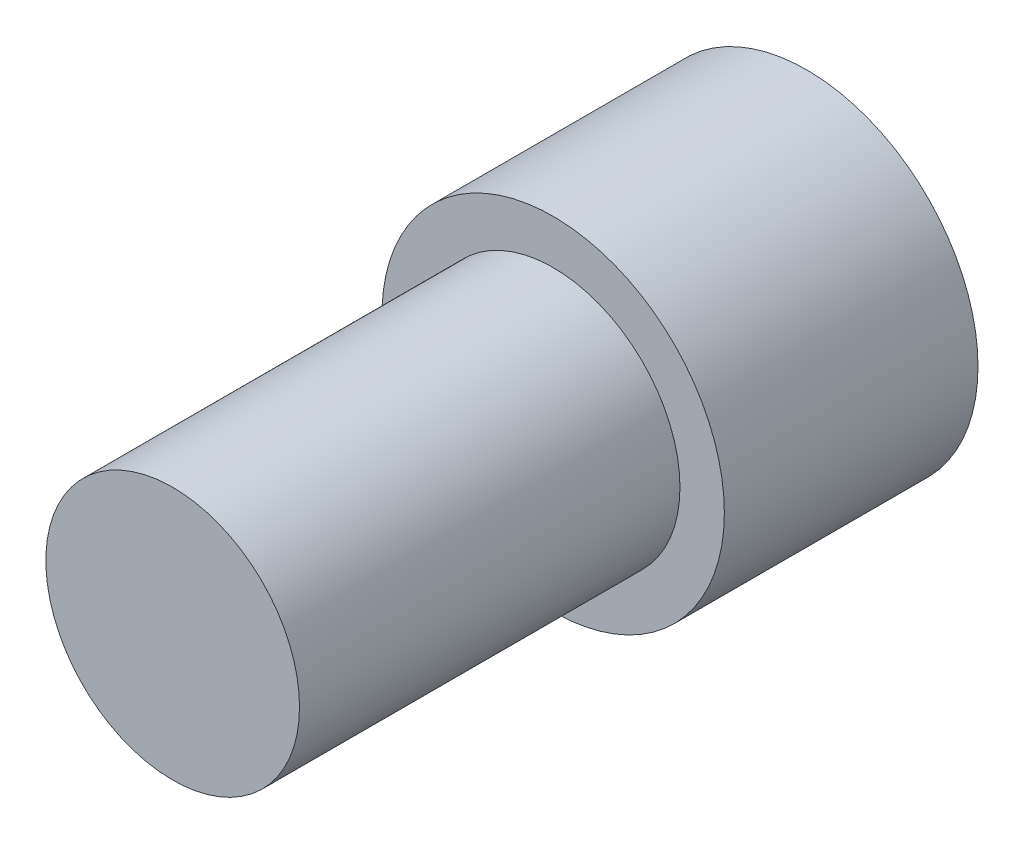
from build123d import *

# Parameters (mm, degrees)
SCHIZZO1_R                   = 13.5
ESTRUSIONE_ESTRUSIONE1_DEPTH = 20
SCHIZZO2_R                   = 10
ESTRUSIONE_ESTRUSIONE2_DEPTH = 30


with BuildPart() as part:
    # Schizzo1 → Estrusione-Estrusione1 (new body)
    with BuildSketch(Plane.XY):
        Circle(SCHIZZO1_R)
    extrude(amount=ESTRUSIONE_ESTRUSIONE1_DEPTH)

    # Schizzo2 → Estrusione-Estrusione2 (add)
    with BuildSketch(Plane.XY.offset(20)):
        Circle(SCHIZZO2_R)
    extrude(amount=ESTRUSIONE_ESTRUSIONE2_DEPTH)


solid = part.part
